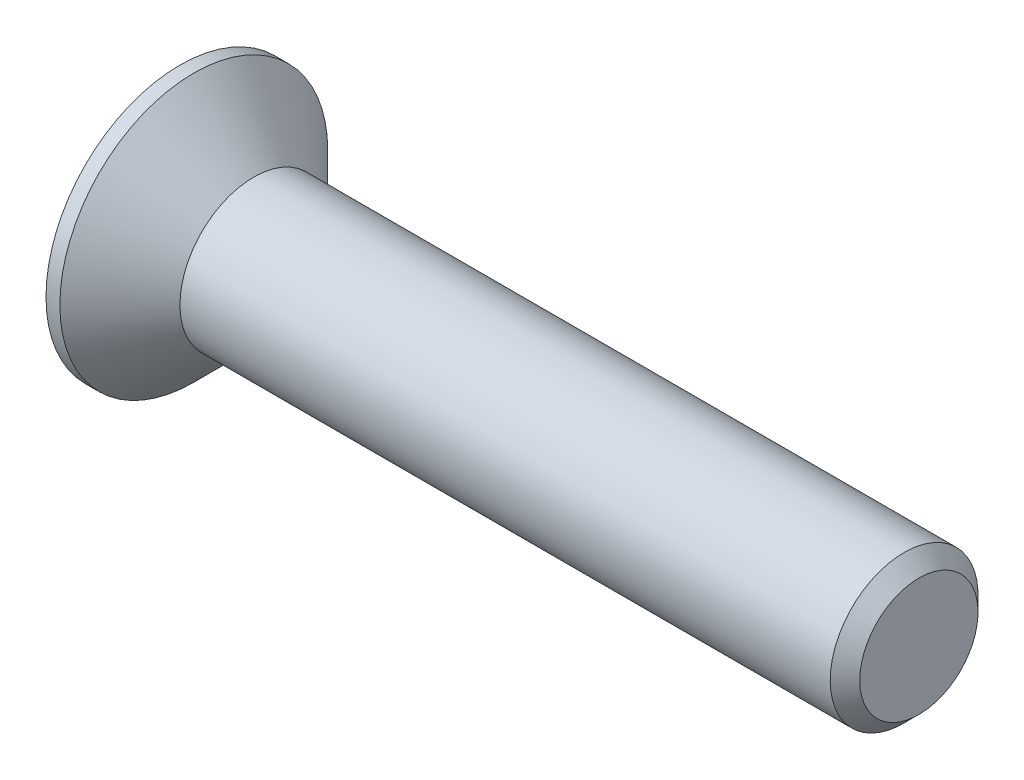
from build123d import *

# Parameters (mm, degrees)
CHAMFER1_SIZE      = 0.8
CUT_EXTRUDE1_DEPTH = 3.45


with BuildPart() as part:
    # Sketch1 → Revolve1 (revolve)
    with BuildSketch(Plane.XY, mode=Mode.PRIVATE) as revolve1_sk:
        Polygon((-4, 7.25), (-4, 0), (36, 0), (36, 4), (0, 4), (-3.25, 7.25), align=None)
    revolve(revolve1_sk.sketch.rotate(Axis((-4, 0, 0), (1, 0, 0)), 90), axis=Axis((-4, 0, 0), (1, 0, 0)))

    # Chamfer1
    chamfer1_edges = [part.edges().sort_by_distance(p)[0] for p in [
        (36, 0, -4),
    ]]
    chamfer(chamfer1_edges, length=CHAMFER1_SIZE)

    # Sketch2 → Cut-Extrude1 (cut)
    with BuildSketch(Plane.ZY.offset(4)):
        Polygon((-1.09, 4.35), (1.09, 4.35), (1.09, 1.09), (4.35, 1.09), (4.35, -1.09), (1.09, -1.09), (1.09, -4.35), (-1.09, -4.35), (-1.09, -1.09), (-4.35, -1.09), (-4.35, 1.09), (-1.09, 1.09), align=None)
    extrude(amount=-CUT_EXTRUDE1_DEPTH, mode=Mode.SUBTRACT)


solid = part.part
